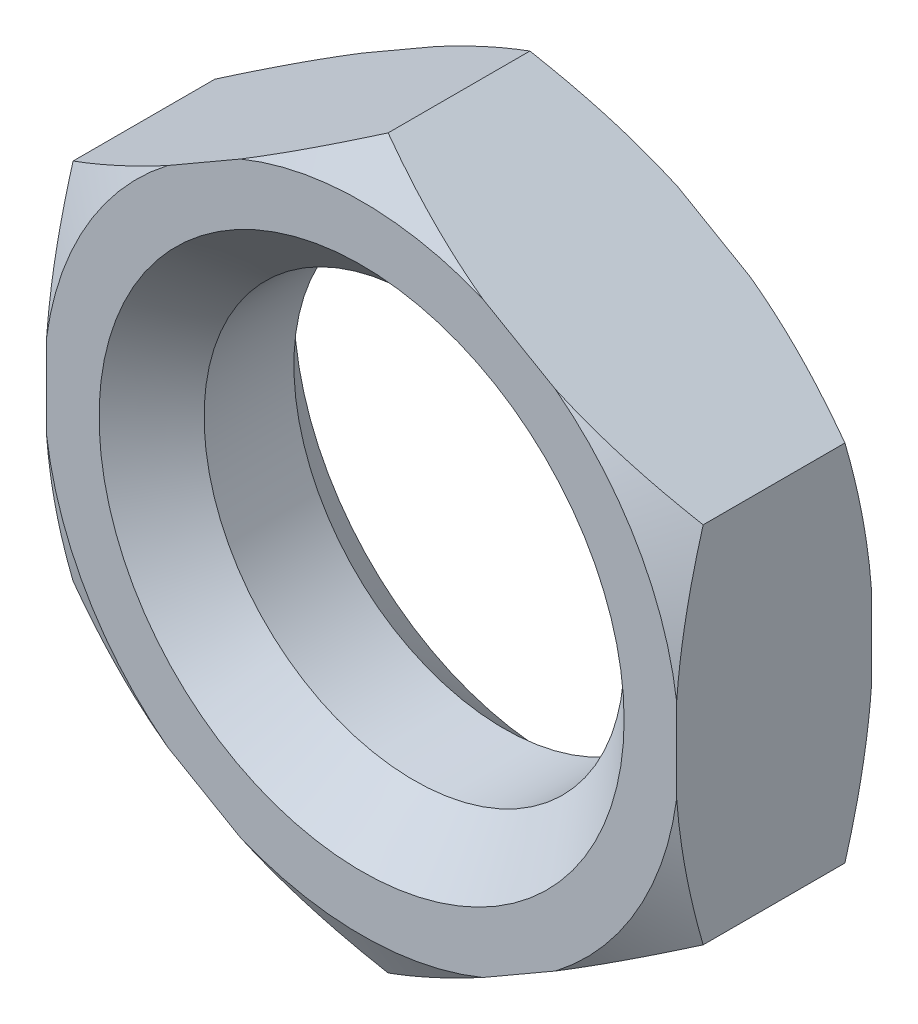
from build123d import *

# Parameters (mm, degrees)
BOSS_EXTRUDE1_DEPTH = 3.71
SKETCH6_R           = 8
CUT_EXTRUDE1_DEPTH  = 7.42
CHAMFER1_SIZE       = 2


with BuildPart() as part:
    # Sketch3 → Boss-Extrude1 (new, symmetric)
    with BuildSketch(Plane.XY):
        Polygon((0, 13.856406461), (-12, 6.92820323), (-12, -6.92820323), (0, -13.856406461), (12, -6.92820323), (12, 6.92820323), align=None)
    extrude(amount=BOSS_EXTRUDE1_DEPTH, both=True)

    # Sketch5 → Cut-Revolve1 (revolve, cut)
    with BuildSketch(Plane(origin=(0, 0, 0), x_dir=(0, 0, -1), z_dir=(1, 0, 0))):
        Polygon((-3.71, 13.856406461), (-3.71, 12.106406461), (-2.699637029, 13.856406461), align=None)
    cut_revolve1 = revolve(axis=Axis((0, 0, 5.457798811), (0, 0, -1)), mode=Mode.SUBTRACT)

    # Mirror1: Cut-Revolve1 across plane
    add(cut_revolve1.mirror(Plane.XY), mode=Mode.SUBTRACT)

    # Sketch6 → Cut-Extrude1 (cut)
    with BuildSketch(Plane.XY.offset(3.71)):
        Circle(SKETCH6_R)
    extrude(amount=-CUT_EXTRUDE1_DEPTH, mode=Mode.SUBTRACT)

    # Chamfer1
    chamfer1_edges = [part.edges().sort_by_distance(p)[0] for p in [
        (-8, 0, -3.71),
        (-8, 0, 3.71),
    ]]
    chamfer(chamfer1_edges, length=CHAMFER1_SIZE)


solid = part.part
